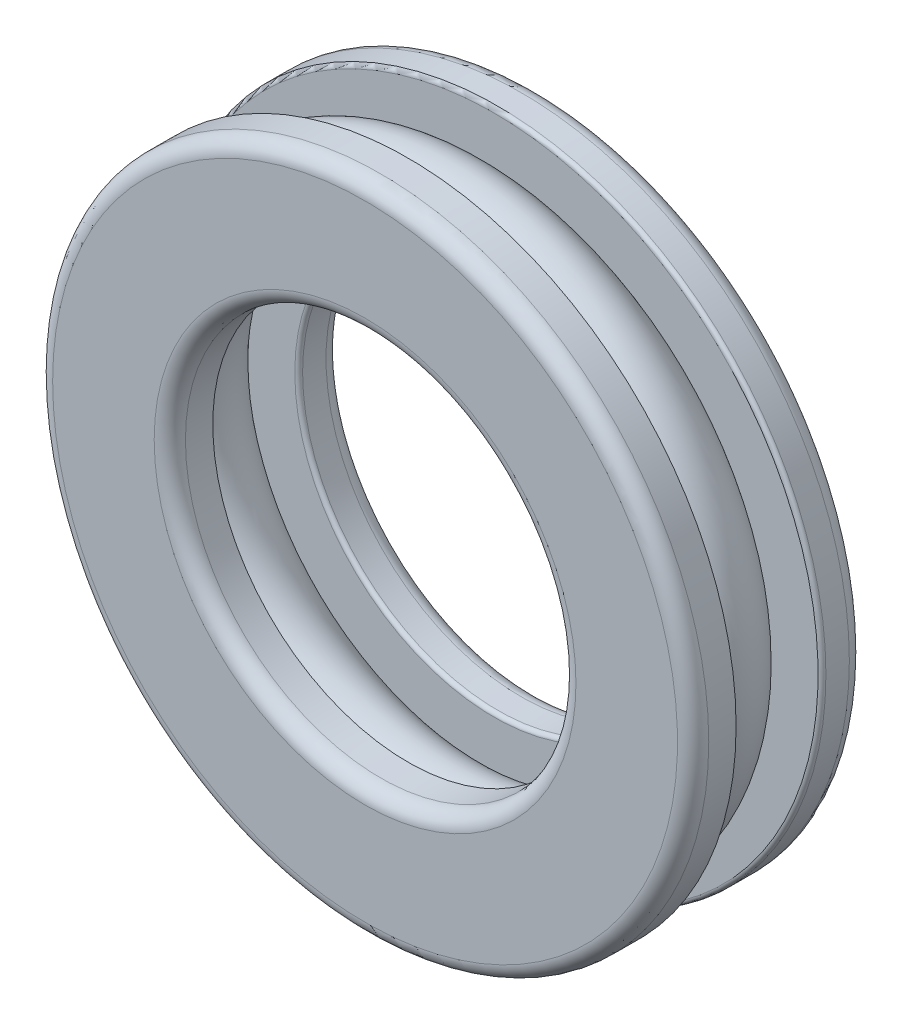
from build123d import *

# Parameters (mm, degrees)
SKETCH_1_R = 2.65
SKETCH_1_W = 8.5
SKETCH_1_H = 2.75
FILLET_1_R = 1
FILLET_2_R = 1
FILLET_3_R = 0.25


with BuildPart() as part:
    # Sketch 1 → Revolve 1 (revolve)
    with BuildSketch(Plane(origin=(0, 0, 0), x_dir=(1, 0, 0), z_dir=(0, 1, 0)), mode=Mode.PRIVATE) as revolve_1_sk:
        with Locations((-16.75, 5.5)):
            Circle(SKETCH_1_R)
        with Locations((-16.75, 1.375)):
            Rectangle(SKETCH_1_W, SKETCH_1_H)
        with Locations((-16.75, 9.625)):
            Rectangle(SKETCH_1_W, SKETCH_1_H)
    revolve(revolve_1_sk.sketch.rotate(Axis((0, 0, 0), (0, 0, -1)), 180), axis=Axis((0, 0, 0), (0, 0, -1)))

    # Fillet 1
    fillet_1_edges = [part.edges().sort_by_distance(p)[0] for p in [
        (-21, 0, 0),
        (-12.5, 0, 0),
    ]]
    fillet(fillet_1_edges, radius=FILLET_1_R)

    # Fillet 2
    fillet_2_edges = [part.edges().sort_by_distance(p)[0] for p in [
        (-21, 0, -11),
        (-12.5, 0, -11),
    ]]
    fillet(fillet_2_edges, radius=FILLET_2_R)

    # Fillet 3
    fillet_3_edges = [part.edges().sort_by_distance(p)[0] for p in [
        (-12.5, 0, -8.25),
        (-21, 0, -8.25),
    ]]
    fillet(fillet_3_edges, radius=FILLET_3_R)


solid = part.part
